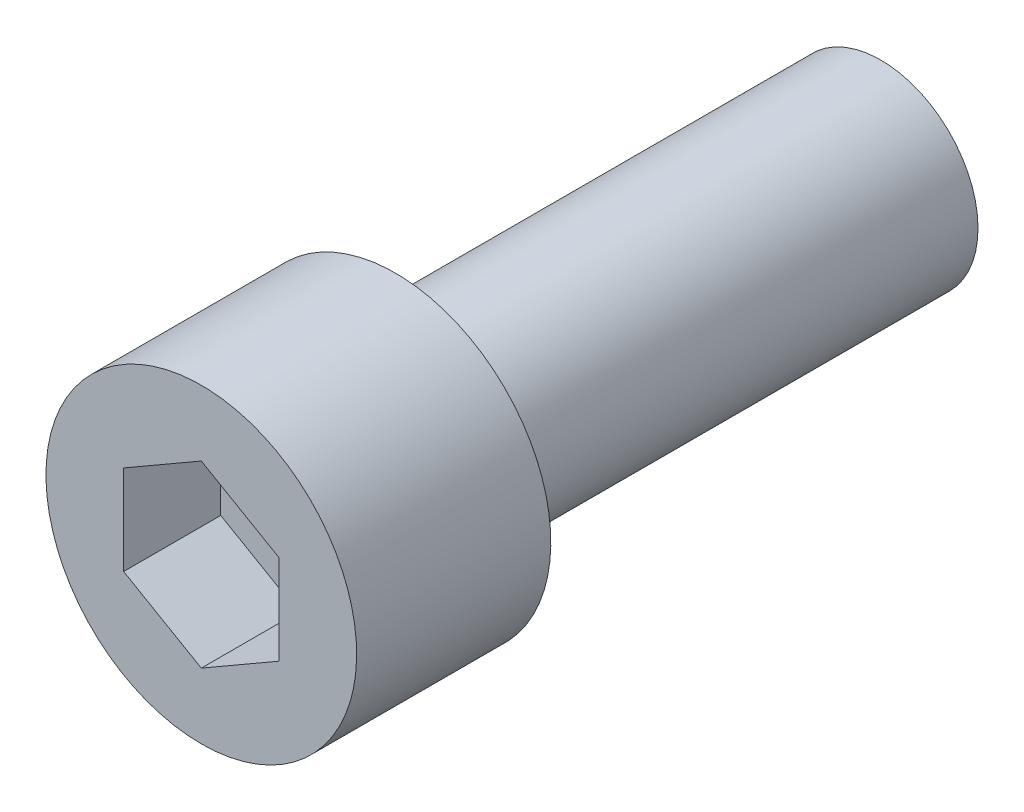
ISO-10303-21;
HEADER;
FILE_DESCRIPTION(('STEP AP214'),'2;1');
FILE_NAME('part.step','',(''),(''),'','','');
FILE_SCHEMA(('AUTOMOTIVE_DESIGN { 1 0 10303 214 1 1 1 1 }'));
ENDSEC;
DATA;
#1=APPLICATION_CONTEXT('core data for automotive mechanical design processes');
#2=APPLICATION_PROTOCOL_DEFINITION('international standard','automotive_design',2000,#1);
#3=PRODUCT_CONTEXT('',#1,'mechanical');
#4=PRODUCT('Part','Part','',(#3));
#5=PRODUCT_RELATED_PRODUCT_CATEGORY('part','',(#4));
#6=PRODUCT_DEFINITION_FORMATION('','',#4);
#7=PRODUCT_DEFINITION_CONTEXT('part definition',#1,'design');
#8=PRODUCT_DEFINITION('design','',#6,#7);
#9=PRODUCT_DEFINITION_SHAPE('','',#8);
#10=(LENGTH_UNIT() NAMED_UNIT(*) SI_UNIT(.MILLI.,.METRE.));
#11=(NAMED_UNIT(*) PLANE_ANGLE_UNIT() SI_UNIT($,.RADIAN.));
#12=(NAMED_UNIT(*) SI_UNIT($,.STERADIAN.) SOLID_ANGLE_UNIT());
#13=UNCERTAINTY_MEASURE_WITH_UNIT(LENGTH_MEASURE(1.E-05),#10,'distance_accuracy_value','');
#14=(GEOMETRIC_REPRESENTATION_CONTEXT(3) GLOBAL_UNCERTAINTY_ASSIGNED_CONTEXT((#13)) GLOBAL_UNIT_ASSIGNED_CONTEXT((#10,
#11,#12)) REPRESENTATION_CONTEXT('',''));
#15=CARTESIAN_POINT('',(0.,0.,0.));
#16=DIRECTION('',(0.,0.,1.));
#17=DIRECTION('',(1.,0.,0.));
#18=AXIS2_PLACEMENT_3D('',#15,#16,#17);
#19=CARTESIAN_POINT('',(0.,0.,0.));
#20=DIRECTION('',(0.,0.,-1.));
#21=DIRECTION('',(-0.866025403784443,-0.499999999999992,0.));
#22=AXIS2_PLACEMENT_3D('',#19,#20,#21);
#23=CYLINDRICAL_SURFACE('',#22,5.);
#24=CARTESIAN_POINT('',(0.,0.,0.));
#25=DIRECTION('',(0.,0.,1.));
#26=DIRECTION('',(0.866025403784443,0.499999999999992,0.));
#27=AXIS2_PLACEMENT_3D('',#24,#25,#26);
#28=CIRCLE('',#27,5.);
#29=CARTESIAN_POINT('',(4.33012701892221,2.49999999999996,0.));
#30=VERTEX_POINT('',#29);
#31=EDGE_CURVE('E9',#30,#30,#28,.T.);
#32=ORIENTED_EDGE('',*,*,#31,.F.);
#33=EDGE_LOOP('',(#32));
#34=FACE_BOUND('',#33,.T.);
#35=CARTESIAN_POINT('',(0.,0.,-25.));
#36=DIRECTION('',(0.,0.,-1.));
#37=DIRECTION('',(-0.866025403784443,-0.499999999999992,0.));
#38=AXIS2_PLACEMENT_3D('',#35,#36,#37);
#39=CIRCLE('',#38,5.);
#40=CARTESIAN_POINT('',(-4.33012701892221,-2.49999999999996,-25.));
#41=VERTEX_POINT('',#40);
#42=EDGE_CURVE('E143',#41,#41,#39,.T.);
#43=ORIENTED_EDGE('',*,*,#42,.F.);
#44=EDGE_LOOP('',(#43));
#45=FACE_BOUND('',#44,.T.);
#46=ADVANCED_FACE('F15',(#34,#45),#23,.T.);
#47=CARTESIAN_POINT('',(0.,0.,0.));
#48=DIRECTION('',(0.,0.,1.));
#49=DIRECTION('',(0.866025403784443,0.499999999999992,0.));
#50=AXIS2_PLACEMENT_3D('',#47,#48,#49);
#51=PLANE('',#50);
#52=CARTESIAN_POINT('',(0.,0.,0.));
#53=DIRECTION('',(0.,0.,1.));
#54=DIRECTION('',(0.866025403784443,0.499999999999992,0.));
#55=AXIS2_PLACEMENT_3D('',#52,#53,#54);
#56=CIRCLE('',#55,8.);
#57=CARTESIAN_POINT('',(6.92820323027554,3.99999999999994,0.));
#58=VERTEX_POINT('',#57);
#59=EDGE_CURVE('E117',#58,#58,#56,.T.);
#60=ORIENTED_EDGE('',*,*,#59,.F.);
#61=EDGE_LOOP('',(#60));
#62=FACE_BOUND('',#61,.T.);
#63=ORIENTED_EDGE('',*,*,#31,.T.);
#64=EDGE_LOOP('',(#63));
#65=FACE_BOUND('',#64,.T.);
#66=ADVANCED_FACE('F131',(#62,#65),#51,.F.);
#67=CARTESIAN_POINT('',(0.,0.,10.));
#68=DIRECTION('',(0.,0.,-1.));
#69=DIRECTION('',(-0.866025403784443,-0.499999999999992,0.));
#70=AXIS2_PLACEMENT_3D('',#67,#68,#69);
#71=CYLINDRICAL_SURFACE('',#70,8.);
#72=CARTESIAN_POINT('',(0.,0.,10.));
#73=DIRECTION('',(0.,0.,1.));
#74=DIRECTION('',(0.866025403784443,0.499999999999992,0.));
#75=AXIS2_PLACEMENT_3D('',#72,#73,#74);
#76=CIRCLE('',#75,8.);
#77=CARTESIAN_POINT('',(6.92820323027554,3.99999999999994,10.));
#78=VERTEX_POINT('',#77);
#79=EDGE_CURVE('E22',#78,#78,#76,.T.);
#80=ORIENTED_EDGE('',*,*,#79,.F.);
#81=EDGE_LOOP('',(#80));
#82=FACE_BOUND('',#81,.T.);
#83=ORIENTED_EDGE('',*,*,#59,.T.);
#84=EDGE_LOOP('',(#83));
#85=FACE_BOUND('',#84,.T.);
#86=ADVANCED_FACE('F128',(#82,#85),#71,.T.);
#87=CARTESIAN_POINT('',(0.,0.,10.));
#88=DIRECTION('',(0.,0.,1.));
#89=DIRECTION('',(0.866025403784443,0.499999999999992,0.));
#90=AXIS2_PLACEMENT_3D('',#87,#88,#89);
#91=PLANE('',#90);
#92=DIRECTION('',(0.,1.,0.));
#93=VECTOR('',#92,1.);
#94=CARTESIAN_POINT('',(4.,-2.30940107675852,10.));
#95=LINE('',#94,#93);
#96=CARTESIAN_POINT('',(4.,-2.30940107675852,10.));
#97=VERTEX_POINT('',#96);
#98=CARTESIAN_POINT('',(4.,2.30940107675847,10.));
#99=VERTEX_POINT('',#98);
#100=EDGE_CURVE('E29',#97,#99,#95,.T.);
#101=ORIENTED_EDGE('',*,*,#100,.F.);
#102=DIRECTION('',(0.86602540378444,0.5,0.));
#103=VECTOR('',#102,1.);
#104=CARTESIAN_POINT('',(0.,-4.61880215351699,10.));
#105=LINE('',#104,#103);
#106=CARTESIAN_POINT('',(0.,-4.61880215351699,10.));
#107=VERTEX_POINT('',#106);
#108=EDGE_CURVE('E99',#107,#97,#105,.T.);
#109=ORIENTED_EDGE('',*,*,#108,.F.);
#110=DIRECTION('',(0.866025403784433,-0.500000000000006,0.));
#111=VECTOR('',#110,1.);
#112=CARTESIAN_POINT('',(-4.,-2.30940107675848,10.));
#113=LINE('',#112,#111);
#114=CARTESIAN_POINT('',(-4.,-2.30940107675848,10.));
#115=VERTEX_POINT('',#114);
#116=EDGE_CURVE('E93',#115,#107,#113,.T.);
#117=ORIENTED_EDGE('',*,*,#116,.F.);
#118=DIRECTION('',(0.,-1.,0.));
#119=VECTOR('',#118,1.);
#120=CARTESIAN_POINT('',(-4.,2.30940107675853,10.));
#121=LINE('',#120,#119);
#122=CARTESIAN_POINT('',(-4.,2.30940107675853,10.));
#123=VERTEX_POINT('',#122);
#124=EDGE_CURVE('E91',#123,#115,#121,.T.);
#125=ORIENTED_EDGE('',*,*,#124,.F.);
#126=DIRECTION('',(-0.86602540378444,-0.5,0.));
#127=VECTOR('',#126,1.);
#128=CARTESIAN_POINT('',(0.,4.61880215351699,10.));
#129=LINE('',#128,#127);
#130=CARTESIAN_POINT('',(0.,4.61880215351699,10.));
#131=VERTEX_POINT('',#130);
#132=EDGE_CURVE('E72',#131,#123,#129,.T.);
#133=ORIENTED_EDGE('',*,*,#132,.F.);
#134=DIRECTION('',(-0.866025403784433,0.500000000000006,0.));
#135=VECTOR('',#134,1.);
#136=CARTESIAN_POINT('',(4.,2.30940107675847,10.));
#137=LINE('',#136,#135);
#138=EDGE_CURVE('E83',#99,#131,#137,.T.);
#139=ORIENTED_EDGE('',*,*,#138,.F.);
#140=EDGE_LOOP('',(#101,#109,#117,#125,#133,#139));
#141=FACE_BOUND('',#140,.T.);
#142=ORIENTED_EDGE('',*,*,#79,.T.);
#143=EDGE_LOOP('',(#142));
#144=FACE_BOUND('',#143,.T.);
#145=ADVANCED_FACE('F87',(#141,#144),#91,.T.);
#146=CARTESIAN_POINT('',(4.,-2.30940107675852,5.));
#147=DIRECTION('',(1.,0.,0.));
#148=DIRECTION('',(0.,1.,0.));
#149=AXIS2_PLACEMENT_3D('',#146,#147,#148);
#150=PLANE('',#149);
#151=ORIENTED_EDGE('',*,*,#100,.T.);
#152=DIRECTION('',(0.,0.,1.));
#153=VECTOR('',#152,1.);
#154=CARTESIAN_POINT('',(4.,2.30940107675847,5.));
#155=LINE('',#154,#153);
#156=CARTESIAN_POINT('',(4.,2.30940107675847,5.));
#157=VERTEX_POINT('',#156);
#158=EDGE_CURVE('E80',#157,#99,#155,.T.);
#159=ORIENTED_EDGE('',*,*,#158,.F.);
#160=DIRECTION('',(0.,1.,0.));
#161=VECTOR('',#160,1.);
#162=CARTESIAN_POINT('',(4.,-2.30940107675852,5.));
#163=LINE('',#162,#161);
#164=CARTESIAN_POINT('',(4.,-2.30940107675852,5.));
#165=VERTEX_POINT('',#164);
#166=EDGE_CURVE('E101',#165,#157,#163,.T.);
#167=ORIENTED_EDGE('',*,*,#166,.F.);
#168=DIRECTION('',(0.,0.,1.));
#169=VECTOR('',#168,1.);
#170=CARTESIAN_POINT('',(4.,-2.30940107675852,5.));
#171=LINE('',#170,#169);
#172=EDGE_CURVE('E36',#165,#97,#171,.T.);
#173=ORIENTED_EDGE('',*,*,#172,.T.);
#174=EDGE_LOOP('',(#151,#159,#167,#173));
#175=FACE_BOUND('',#174,.T.);
#176=ADVANCED_FACE('F162',(#175),#150,.F.);
#177=CARTESIAN_POINT('',(0.,-4.61880215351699,5.));
#178=DIRECTION('',(0.5,-0.86602540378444,0.));
#179=DIRECTION('',(0.86602540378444,0.5,0.));
#180=AXIS2_PLACEMENT_3D('',#177,#178,#179);
#181=PLANE('',#180);
#182=ORIENTED_EDGE('',*,*,#108,.T.);
#183=ORIENTED_EDGE('',*,*,#172,.F.);
#184=DIRECTION('',(0.86602540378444,0.5,0.));
#185=VECTOR('',#184,1.);
#186=CARTESIAN_POINT('',(0.,-4.61880215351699,5.));
#187=LINE('',#186,#185);
#188=CARTESIAN_POINT('',(0.,-4.61880215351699,5.));
#189=VERTEX_POINT('',#188);
#190=EDGE_CURVE('E113',#189,#165,#187,.T.);
#191=ORIENTED_EDGE('',*,*,#190,.F.);
#192=DIRECTION('',(0.,0.,1.));
#193=VECTOR('',#192,1.);
#194=CARTESIAN_POINT('',(0.,-4.61880215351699,5.));
#195=LINE('',#194,#193);
#196=EDGE_CURVE('E118',#189,#107,#195,.T.);
#197=ORIENTED_EDGE('',*,*,#196,.T.);
#198=EDGE_LOOP('',(#182,#183,#191,#197));
#199=FACE_BOUND('',#198,.T.);
#200=ADVANCED_FACE('F158',(#199),#181,.F.);
#201=CARTESIAN_POINT('',(-4.,-2.30940107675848,5.));
#202=DIRECTION('',(-0.500000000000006,-0.866025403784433,0.));
#203=DIRECTION('',(0.866025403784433,-0.500000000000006,0.));
#204=AXIS2_PLACEMENT_3D('',#201,#202,#203);
#205=PLANE('',#204);
#206=ORIENTED_EDGE('',*,*,#116,.T.);
#207=ORIENTED_EDGE('',*,*,#196,.F.);
#208=DIRECTION('',(0.866025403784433,-0.500000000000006,0.));
#209=VECTOR('',#208,1.);
#210=CARTESIAN_POINT('',(-4.,-2.30940107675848,5.));
#211=LINE('',#210,#209);
#212=CARTESIAN_POINT('',(-4.,-2.30940107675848,5.));
#213=VERTEX_POINT('',#212);
#214=EDGE_CURVE('E110',#213,#189,#211,.T.);
#215=ORIENTED_EDGE('',*,*,#214,.F.);
#216=DIRECTION('',(0.,0.,1.));
#217=VECTOR('',#216,1.);
#218=CARTESIAN_POINT('',(-4.,-2.30940107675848,5.));
#219=LINE('',#218,#217);
#220=EDGE_CURVE('E120',#213,#115,#219,.T.);
#221=ORIENTED_EDGE('',*,*,#220,.T.);
#222=EDGE_LOOP('',(#206,#207,#215,#221));
#223=FACE_BOUND('',#222,.T.);
#224=ADVANCED_FACE('F161',(#223),#205,.F.);
#225=CARTESIAN_POINT('',(-4.,2.30940107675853,5.));
#226=DIRECTION('',(-1.,0.,0.));
#227=DIRECTION('',(0.,-1.,0.));
#228=AXIS2_PLACEMENT_3D('',#225,#226,#227);
#229=PLANE('',#228);
#230=ORIENTED_EDGE('',*,*,#124,.T.);
#231=ORIENTED_EDGE('',*,*,#220,.F.);
#232=DIRECTION('',(0.,-1.,0.));
#233=VECTOR('',#232,1.);
#234=CARTESIAN_POINT('',(-4.,2.30940107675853,5.));
#235=LINE('',#234,#233);
#236=CARTESIAN_POINT('',(-4.,2.30940107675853,5.));
#237=VERTEX_POINT('',#236);
#238=EDGE_CURVE('E107',#237,#213,#235,.T.);
#239=ORIENTED_EDGE('',*,*,#238,.F.);
#240=DIRECTION('',(0.,0.,1.));
#241=VECTOR('',#240,1.);
#242=CARTESIAN_POINT('',(-4.,2.30940107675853,5.));
#243=LINE('',#242,#241);
#244=EDGE_CURVE('E79',#237,#123,#243,.T.);
#245=ORIENTED_EDGE('',*,*,#244,.T.);
#246=EDGE_LOOP('',(#230,#231,#239,#245));
#247=FACE_BOUND('',#246,.T.);
#248=ADVANCED_FACE('F165',(#247),#229,.F.);
#249=CARTESIAN_POINT('',(0.,4.61880215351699,5.));
#250=DIRECTION('',(-0.5,0.86602540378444,0.));
#251=DIRECTION('',(-0.86602540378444,-0.5,0.));
#252=AXIS2_PLACEMENT_3D('',#249,#250,#251);
#253=PLANE('',#252);
#254=ORIENTED_EDGE('',*,*,#132,.T.);
#255=ORIENTED_EDGE('',*,*,#244,.F.);
#256=DIRECTION('',(-0.86602540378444,-0.5,0.));
#257=VECTOR('',#256,1.);
#258=CARTESIAN_POINT('',(0.,4.61880215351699,5.));
#259=LINE('',#258,#257);
#260=CARTESIAN_POINT('',(0.,4.61880215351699,5.));
#261=VERTEX_POINT('',#260);
#262=EDGE_CURVE('E75',#261,#237,#259,.T.);
#263=ORIENTED_EDGE('',*,*,#262,.F.);
#264=DIRECTION('',(0.,0.,1.));
#265=VECTOR('',#264,1.);
#266=CARTESIAN_POINT('',(0.,4.61880215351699,5.));
#267=LINE('',#266,#265);
#268=EDGE_CURVE('E68',#261,#131,#267,.T.);
#269=ORIENTED_EDGE('',*,*,#268,.T.);
#270=EDGE_LOOP('',(#254,#255,#263,#269));
#271=FACE_BOUND('',#270,.T.);
#272=ADVANCED_FACE('F70',(#271),#253,.F.);
#273=CARTESIAN_POINT('',(4.,2.30940107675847,5.));
#274=DIRECTION('',(0.500000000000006,0.866025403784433,0.));
#275=DIRECTION('',(-0.866025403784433,0.500000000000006,0.));
#276=AXIS2_PLACEMENT_3D('',#273,#274,#275);
#277=PLANE('',#276);
#278=ORIENTED_EDGE('',*,*,#138,.T.);
#279=ORIENTED_EDGE('',*,*,#268,.F.);
#280=DIRECTION('',(-0.866025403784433,0.500000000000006,0.));
#281=VECTOR('',#280,1.);
#282=CARTESIAN_POINT('',(4.,2.30940107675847,5.));
#283=LINE('',#282,#281);
#284=EDGE_CURVE('E104',#157,#261,#283,.T.);
#285=ORIENTED_EDGE('',*,*,#284,.F.);
#286=ORIENTED_EDGE('',*,*,#158,.T.);
#287=EDGE_LOOP('',(#278,#279,#285,#286));
#288=FACE_BOUND('',#287,.T.);
#289=ADVANCED_FACE('F84',(#288),#277,.F.);
#290=CARTESIAN_POINT('',(4.,2.30940107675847,5.));
#291=DIRECTION('',(0.,0.,1.));
#292=DIRECTION('',(0.866025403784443,0.499999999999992,0.));
#293=AXIS2_PLACEMENT_3D('',#290,#291,#292);
#294=PLANE('',#293);
#295=ORIENTED_EDGE('',*,*,#166,.T.);
#296=ORIENTED_EDGE('',*,*,#284,.T.);
#297=ORIENTED_EDGE('',*,*,#262,.T.);
#298=ORIENTED_EDGE('',*,*,#238,.T.);
#299=ORIENTED_EDGE('',*,*,#214,.T.);
#300=ORIENTED_EDGE('',*,*,#190,.T.);
#301=EDGE_LOOP('',(#295,#296,#297,#298,#299,#300));
#302=FACE_BOUND('',#301,.T.);
#303=ADVANCED_FACE('F148',(#302),#294,.T.);
#304=CARTESIAN_POINT('',(0.,0.,-25.));
#305=DIRECTION('',(0.,0.,-1.));
#306=DIRECTION('',(-0.866025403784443,-0.499999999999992,0.));
#307=AXIS2_PLACEMENT_3D('',#304,#305,#306);
#308=PLANE('',#307);
#309=ORIENTED_EDGE('',*,*,#42,.T.);
#310=EDGE_LOOP('',(#309));
#311=FACE_BOUND('',#310,.T.);
#312=ADVANCED_FACE('F146',(#311),#308,.T.);
#313=CLOSED_SHELL('',(#46,#66,#86,#145,#176,#200,#224,#248,#272,#289,#303,#312));
#314=MANIFOLD_SOLID_BREP('B1',#313);
#315=ADVANCED_BREP_SHAPE_REPRESENTATION('',(#18,#314),#14);
#316=SHAPE_DEFINITION_REPRESENTATION(#9,#315);
ENDSEC;
END-ISO-10303-21;
